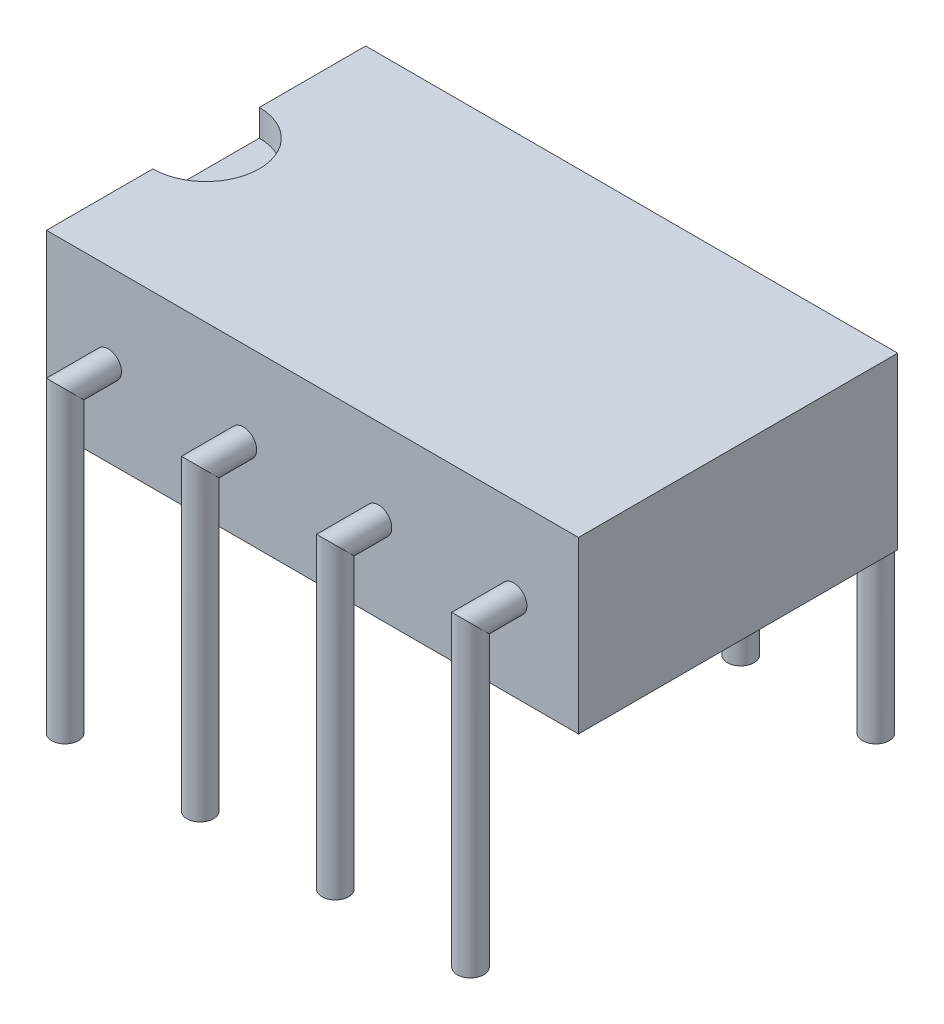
ISO-10303-21;
HEADER;
FILE_DESCRIPTION(('STEP AP214'),'2;1');
FILE_NAME('part.step','',(''),(''),'','','');
FILE_SCHEMA(('AUTOMOTIVE_DESIGN { 1 0 10303 214 1 1 1 1 }'));
ENDSEC;
DATA;
#1=APPLICATION_CONTEXT('core data for automotive mechanical design processes');
#2=APPLICATION_PROTOCOL_DEFINITION('international standard','automotive_design',2000,#1);
#3=PRODUCT_CONTEXT('',#1,'mechanical');
#4=PRODUCT('Part','Part','',(#3));
#5=PRODUCT_RELATED_PRODUCT_CATEGORY('part','',(#4));
#6=PRODUCT_DEFINITION_FORMATION('','',#4);
#7=PRODUCT_DEFINITION_CONTEXT('part definition',#1,'design');
#8=PRODUCT_DEFINITION('design','',#6,#7);
#9=PRODUCT_DEFINITION_SHAPE('','',#8);
#10=(LENGTH_UNIT() NAMED_UNIT(*) SI_UNIT(.MILLI.,.METRE.));
#11=(NAMED_UNIT(*) PLANE_ANGLE_UNIT() SI_UNIT($,.RADIAN.));
#12=(NAMED_UNIT(*) SI_UNIT($,.STERADIAN.) SOLID_ANGLE_UNIT());
#13=UNCERTAINTY_MEASURE_WITH_UNIT(LENGTH_MEASURE(1.E-05),#10,'distance_accuracy_value','');
#14=(GEOMETRIC_REPRESENTATION_CONTEXT(3) GLOBAL_UNCERTAINTY_ASSIGNED_CONTEXT((#13)) GLOBAL_UNIT_ASSIGNED_CONTEXT((#10,
#11,#12)) REPRESENTATION_CONTEXT('',''));
#15=CARTESIAN_POINT('',(0.,0.,0.));
#16=DIRECTION('',(0.,0.,1.));
#17=DIRECTION('',(1.,0.,0.));
#18=AXIS2_PLACEMENT_3D('',#15,#16,#17);
#19=CARTESIAN_POINT('',(10.,3.2,3.));
#20=DIRECTION('',(0.,0.,-1.));
#21=DIRECTION('',(-1.,0.,0.));
#22=AXIS2_PLACEMENT_3D('',#19,#20,#21);
#23=PLANE('',#22);
#24=CARTESIAN_POINT('',(6.24,1.6,3.));
#25=DIRECTION('',(0.,0.,-1.));
#26=DIRECTION('',(-1.,0.,0.));
#27=AXIS2_PLACEMENT_3D('',#24,#25,#26);
#28=CIRCLE('',#27,0.25);
#29=CARTESIAN_POINT('',(5.99,1.6,3.));
#30=VERTEX_POINT('',#29);
#31=EDGE_CURVE('E49',#30,#30,#28,.F.);
#32=ORIENTED_EDGE('',*,*,#31,.F.);
#33=EDGE_LOOP('',(#32));
#34=FACE_BOUND('',#33,.T.);
#35=CARTESIAN_POINT('',(1.16,1.6,3.));
#36=DIRECTION('',(0.,0.,-1.));
#37=DIRECTION('',(-1.,0.,0.));
#38=AXIS2_PLACEMENT_3D('',#35,#36,#37);
#39=CIRCLE('',#38,0.25);
#40=CARTESIAN_POINT('',(0.91,1.6,3.));
#41=VERTEX_POINT('',#40);
#42=EDGE_CURVE('E146',#41,#41,#39,.F.);
#43=ORIENTED_EDGE('',*,*,#42,.F.);
#44=EDGE_LOOP('',(#43));
#45=FACE_BOUND('',#44,.T.);
#46=DIRECTION('',(0.,-1.,0.));
#47=VECTOR('',#46,1.);
#48=CARTESIAN_POINT('',(0.,3.2,3.));
#49=LINE('',#48,#47);
#50=CARTESIAN_POINT('',(0.,3.2,3.));
#51=VERTEX_POINT('',#50);
#52=CARTESIAN_POINT('',(0.,0.,3.));
#53=VERTEX_POINT('',#52);
#54=EDGE_CURVE('E116',#51,#53,#49,.T.);
#55=ORIENTED_EDGE('',*,*,#54,.T.);
#56=DIRECTION('',(-1.,0.,0.));
#57=VECTOR('',#56,1.);
#58=CARTESIAN_POINT('',(10.,0.,3.));
#59=LINE('',#58,#57);
#60=CARTESIAN_POINT('',(10.,0.,3.));
#61=VERTEX_POINT('',#60);
#62=EDGE_CURVE('E144',#61,#53,#59,.T.);
#63=ORIENTED_EDGE('',*,*,#62,.F.);
#64=DIRECTION('',(0.,-1.,0.));
#65=VECTOR('',#64,1.);
#66=CARTESIAN_POINT('',(10.,3.2,3.));
#67=LINE('',#66,#65);
#68=CARTESIAN_POINT('',(10.,3.2,3.));
#69=VERTEX_POINT('',#68);
#70=EDGE_CURVE('E124',#69,#61,#67,.T.);
#71=ORIENTED_EDGE('',*,*,#70,.F.);
#72=DIRECTION('',(-1.,0.,0.));
#73=VECTOR('',#72,1.);
#74=CARTESIAN_POINT('',(10.,3.2,3.));
#75=LINE('',#74,#73);
#76=EDGE_CURVE('E130',#69,#51,#75,.T.);
#77=ORIENTED_EDGE('',*,*,#76,.T.);
#78=EDGE_LOOP('',(#55,#63,#71,#77));
#79=FACE_BOUND('',#78,.T.);
#80=CARTESIAN_POINT('',(3.7,1.6,3.));
#81=DIRECTION('',(0.,0.,-1.));
#82=DIRECTION('',(-1.,0.,0.));
#83=AXIS2_PLACEMENT_3D('',#80,#81,#82);
#84=CIRCLE('',#83,0.25);
#85=CARTESIAN_POINT('',(3.45,1.6,3.));
#86=VERTEX_POINT('',#85);
#87=EDGE_CURVE('E149',#86,#86,#84,.F.);
#88=ORIENTED_EDGE('',*,*,#87,.F.);
#89=EDGE_LOOP('',(#88));
#90=FACE_BOUND('',#89,.T.);
#91=CARTESIAN_POINT('',(8.78,1.6,3.));
#92=DIRECTION('',(0.,0.,-1.));
#93=DIRECTION('',(-1.,0.,0.));
#94=AXIS2_PLACEMENT_3D('',#91,#92,#93);
#95=CIRCLE('',#94,0.25);
#96=CARTESIAN_POINT('',(8.53,1.6,3.));
#97=VERTEX_POINT('',#96);
#98=EDGE_CURVE('E12',#97,#97,#95,.F.);
#99=ORIENTED_EDGE('',*,*,#98,.F.);
#100=EDGE_LOOP('',(#99));
#101=FACE_BOUND('',#100,.T.);
#102=ADVANCED_FACE('F42',(#34,#45,#79,#90,#101),#23,.F.);
#103=CARTESIAN_POINT('',(10.,0.,3.));
#104=DIRECTION('',(0.,1.,0.));
#105=DIRECTION('',(0.,0.,1.));
#106=AXIS2_PLACEMENT_3D('',#103,#104,#105);
#107=PLANE('',#106);
#108=DIRECTION('',(0.,0.,-1.));
#109=VECTOR('',#108,1.);
#110=CARTESIAN_POINT('',(0.,0.,3.));
#111=LINE('',#110,#109);
#112=CARTESIAN_POINT('',(0.,0.,-3.));
#113=VERTEX_POINT('',#112);
#114=EDGE_CURVE('E119',#53,#113,#111,.T.);
#115=ORIENTED_EDGE('',*,*,#114,.T.);
#116=DIRECTION('',(-1.,0.,0.));
#117=VECTOR('',#116,1.);
#118=CARTESIAN_POINT('',(10.,0.,-3.));
#119=LINE('',#118,#117);
#120=CARTESIAN_POINT('',(10.,0.,-3.));
#121=VERTEX_POINT('',#120);
#122=EDGE_CURVE('E141',#121,#113,#119,.T.);
#123=ORIENTED_EDGE('',*,*,#122,.F.);
#124=DIRECTION('',(0.,0.,-1.));
#125=VECTOR('',#124,1.);
#126=CARTESIAN_POINT('',(10.,0.,3.));
#127=LINE('',#126,#125);
#128=EDGE_CURVE('E93',#61,#121,#127,.T.);
#129=ORIENTED_EDGE('',*,*,#128,.F.);
#130=ORIENTED_EDGE('',*,*,#62,.T.);
#131=EDGE_LOOP('',(#115,#123,#129,#130));
#132=FACE_BOUND('',#131,.T.);
#133=ADVANCED_FACE('F159',(#132),#107,.F.);
#134=CARTESIAN_POINT('',(10.,3.2,-3.));
#135=DIRECTION('',(0.,0.,1.));
#136=DIRECTION('',(1.,0.,0.));
#137=AXIS2_PLACEMENT_3D('',#134,#135,#136);
#138=PLANE('',#137);
#139=CARTESIAN_POINT('',(8.78,1.6,-3.));
#140=DIRECTION('',(0.,0.,1.));
#141=DIRECTION('',(1.,0.,0.));
#142=AXIS2_PLACEMENT_3D('',#139,#140,#141);
#143=CIRCLE('',#142,0.25);
#144=CARTESIAN_POINT('',(9.03,1.6,-3.));
#145=VERTEX_POINT('',#144);
#146=EDGE_CURVE('E523',#145,#145,#143,.T.);
#147=ORIENTED_EDGE('',*,*,#146,.T.);
#148=EDGE_LOOP('',(#147));
#149=FACE_BOUND('',#148,.T.);
#150=CARTESIAN_POINT('',(6.24,1.6,-3.));
#151=DIRECTION('',(0.,0.,1.));
#152=DIRECTION('',(1.,0.,0.));
#153=AXIS2_PLACEMENT_3D('',#150,#151,#152);
#154=CIRCLE('',#153,0.25);
#155=CARTESIAN_POINT('',(6.49,1.6,-3.));
#156=VERTEX_POINT('',#155);
#157=EDGE_CURVE('E516',#156,#156,#154,.T.);
#158=ORIENTED_EDGE('',*,*,#157,.T.);
#159=EDGE_LOOP('',(#158));
#160=FACE_BOUND('',#159,.T.);
#161=CARTESIAN_POINT('',(3.7,1.6,-3.));
#162=DIRECTION('',(0.,0.,1.));
#163=DIRECTION('',(1.,0.,0.));
#164=AXIS2_PLACEMENT_3D('',#161,#162,#163);
#165=CIRCLE('',#164,0.25);
#166=CARTESIAN_POINT('',(3.95,1.6,-3.));
#167=VERTEX_POINT('',#166);
#168=EDGE_CURVE('E532',#167,#167,#165,.T.);
#169=ORIENTED_EDGE('',*,*,#168,.T.);
#170=EDGE_LOOP('',(#169));
#171=FACE_BOUND('',#170,.T.);
#172=CARTESIAN_POINT('',(1.16,1.6,-3.));
#173=DIRECTION('',(0.,0.,1.));
#174=DIRECTION('',(1.,0.,0.));
#175=AXIS2_PLACEMENT_3D('',#172,#173,#174);
#176=CIRCLE('',#175,0.25);
#177=CARTESIAN_POINT('',(1.41,1.6,-3.));
#178=VERTEX_POINT('',#177);
#179=EDGE_CURVE('E200',#178,#178,#176,.T.);
#180=ORIENTED_EDGE('',*,*,#179,.T.);
#181=EDGE_LOOP('',(#180));
#182=FACE_BOUND('',#181,.T.);
#183=DIRECTION('',(0.,1.,0.));
#184=VECTOR('',#183,1.);
#185=CARTESIAN_POINT('',(0.,3.2,-3.));
#186=LINE('',#185,#184);
#187=CARTESIAN_POINT('',(0.,3.2,-3.));
#188=VERTEX_POINT('',#187);
#189=EDGE_CURVE('E133',#113,#188,#186,.T.);
#190=ORIENTED_EDGE('',*,*,#189,.T.);
#191=DIRECTION('',(-1.,0.,0.));
#192=VECTOR('',#191,1.);
#193=CARTESIAN_POINT('',(10.,3.2,-3.));
#194=LINE('',#193,#192);
#195=CARTESIAN_POINT('',(10.,3.2,-3.));
#196=VERTEX_POINT('',#195);
#197=EDGE_CURVE('E138',#196,#188,#194,.T.);
#198=ORIENTED_EDGE('',*,*,#197,.F.);
#199=DIRECTION('',(0.,1.,0.));
#200=VECTOR('',#199,1.);
#201=CARTESIAN_POINT('',(10.,3.2,-3.));
#202=LINE('',#201,#200);
#203=EDGE_CURVE('E128',#121,#196,#202,.T.);
#204=ORIENTED_EDGE('',*,*,#203,.F.);
#205=ORIENTED_EDGE('',*,*,#122,.T.);
#206=EDGE_LOOP('',(#190,#198,#204,#205));
#207=FACE_BOUND('',#206,.T.);
#208=ADVANCED_FACE('F222',(#149,#160,#171,#182,#207),#138,.F.);
#209=CARTESIAN_POINT('',(10.,3.2,3.));
#210=DIRECTION('',(0.,-1.,0.));
#211=DIRECTION('',(0.,0.,-1.));
#212=AXIS2_PLACEMENT_3D('',#209,#210,#211);
#213=PLANE('',#212);
#214=DIRECTION('',(0.,0.,1.));
#215=VECTOR('',#214,1.);
#216=CARTESIAN_POINT('',(0.,3.2,3.));
#217=LINE('',#216,#215);
#218=CARTESIAN_POINT('',(0.,3.2,-1.));
#219=VERTEX_POINT('',#218);
#220=EDGE_CURVE('E126',#188,#219,#217,.T.);
#221=ORIENTED_EDGE('',*,*,#220,.T.);
#222=CARTESIAN_POINT('',(0.,3.2,0.));
#223=DIRECTION('',(0.,1.,0.));
#224=DIRECTION('',(0.,0.,1.));
#225=AXIS2_PLACEMENT_3D('',#222,#223,#224);
#226=CIRCLE('',#225,1.);
#227=CARTESIAN_POINT('',(0.,3.2,1.));
#228=VERTEX_POINT('',#227);
#229=EDGE_CURVE('E109',#228,#219,#226,.T.);
#230=ORIENTED_EDGE('',*,*,#229,.F.);
#231=EDGE_CURVE('E85',#228,#51,#217,.T.);
#232=ORIENTED_EDGE('',*,*,#231,.T.);
#233=ORIENTED_EDGE('',*,*,#76,.F.);
#234=DIRECTION('',(0.,0.,1.));
#235=VECTOR('',#234,1.);
#236=CARTESIAN_POINT('',(10.,3.2,3.));
#237=LINE('',#236,#235);
#238=EDGE_CURVE('E64',#196,#69,#237,.T.);
#239=ORIENTED_EDGE('',*,*,#238,.F.);
#240=ORIENTED_EDGE('',*,*,#197,.T.);
#241=EDGE_LOOP('',(#221,#230,#232,#233,#239,#240));
#242=FACE_BOUND('',#241,.T.);
#243=ADVANCED_FACE('F218',(#242),#213,.F.);
#244=CARTESIAN_POINT('',(10.,0.,3.));
#245=DIRECTION('',(1.,0.,0.));
#246=DIRECTION('',(0.,0.,-1.));
#247=AXIS2_PLACEMENT_3D('',#244,#245,#246);
#248=PLANE('',#247);
#249=ORIENTED_EDGE('',*,*,#70,.T.);
#250=ORIENTED_EDGE('',*,*,#128,.T.);
#251=ORIENTED_EDGE('',*,*,#203,.T.);
#252=ORIENTED_EDGE('',*,*,#238,.T.);
#253=EDGE_LOOP('',(#249,#250,#251,#252));
#254=FACE_BOUND('',#253,.T.);
#255=ADVANCED_FACE('F224',(#254),#248,.T.);
#256=CARTESIAN_POINT('',(0.,0.,3.));
#257=DIRECTION('',(1.,0.,0.));
#258=DIRECTION('',(0.,0.,-1.));
#259=AXIS2_PLACEMENT_3D('',#256,#257,#258);
#260=PLANE('',#259);
#261=DIRECTION('',(0.,0.,1.));
#262=VECTOR('',#261,1.);
#263=CARTESIAN_POINT('',(0.,2.7,-1.));
#264=LINE('',#263,#262);
#265=CARTESIAN_POINT('',(0.,2.7,-1.));
#266=VERTEX_POINT('',#265);
#267=CARTESIAN_POINT('',(0.,2.7,1.));
#268=VERTEX_POINT('',#267);
#269=EDGE_CURVE('E108',#266,#268,#264,.T.);
#270=ORIENTED_EDGE('',*,*,#269,.F.);
#271=DIRECTION('',(0.,1.,0.));
#272=VECTOR('',#271,1.);
#273=CARTESIAN_POINT('',(0.,2.7,-1.));
#274=LINE('',#273,#272);
#275=EDGE_CURVE('E106',#266,#219,#274,.T.);
#276=ORIENTED_EDGE('',*,*,#275,.T.);
#277=ORIENTED_EDGE('',*,*,#220,.F.);
#278=ORIENTED_EDGE('',*,*,#189,.F.);
#279=ORIENTED_EDGE('',*,*,#114,.F.);
#280=ORIENTED_EDGE('',*,*,#54,.F.);
#281=ORIENTED_EDGE('',*,*,#231,.F.);
#282=DIRECTION('',(0.,1.,0.));
#283=VECTOR('',#282,1.);
#284=CARTESIAN_POINT('',(0.,2.7,1.));
#285=LINE('',#284,#283);
#286=EDGE_CURVE('E104',#268,#228,#285,.T.);
#287=ORIENTED_EDGE('',*,*,#286,.F.);
#288=EDGE_LOOP('',(#270,#276,#277,#278,#279,#280,#281,#287));
#289=FACE_BOUND('',#288,.T.);
#290=ADVANCED_FACE('F114',(#289),#260,.F.);
#291=CARTESIAN_POINT('',(0.,2.7,0.));
#292=DIRECTION('',(0.,1.,0.));
#293=DIRECTION('',(0.,0.,1.));
#294=AXIS2_PLACEMENT_3D('',#291,#292,#293);
#295=CYLINDRICAL_SURFACE('',#294,1.);
#296=ORIENTED_EDGE('',*,*,#229,.T.);
#297=ORIENTED_EDGE('',*,*,#275,.F.);
#298=CARTESIAN_POINT('',(0.,2.7,0.));
#299=DIRECTION('',(0.,1.,0.));
#300=DIRECTION('',(0.,0.,1.));
#301=AXIS2_PLACEMENT_3D('',#298,#299,#300);
#302=CIRCLE('',#301,1.);
#303=EDGE_CURVE('E55',#268,#266,#302,.T.);
#304=ORIENTED_EDGE('',*,*,#303,.F.);
#305=ORIENTED_EDGE('',*,*,#286,.T.);
#306=EDGE_LOOP('',(#296,#297,#304,#305));
#307=FACE_BOUND('',#306,.T.);
#308=ADVANCED_FACE('F102',(#307),#295,.F.);
#309=CARTESIAN_POINT('',(0.,2.7,0.));
#310=DIRECTION('',(0.,1.,0.));
#311=DIRECTION('',(0.,0.,1.));
#312=AXIS2_PLACEMENT_3D('',#309,#310,#311);
#313=PLANE('',#312);
#314=ORIENTED_EDGE('',*,*,#303,.T.);
#315=ORIENTED_EDGE('',*,*,#269,.T.);
#316=EDGE_LOOP('',(#314,#315));
#317=FACE_BOUND('',#316,.T.);
#318=ADVANCED_FACE('F111',(#317),#313,.T.);
#319=CARTESIAN_POINT('',(1.16,1.6,3.81));
#320=DIRECTION('',(0.,-1.,0.));
#321=DIRECTION('',(0.,0.,-1.));
#322=AXIS2_PLACEMENT_3D('',#319,#320,#321);
#323=CYLINDRICAL_SURFACE('',#322,0.25);
#324=CARTESIAN_POINT('',(1.16,1.6,3.81));
#325=DIRECTION('',(0.,-0.707106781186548,0.707106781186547));
#326=DIRECTION('',(0.,-0.707106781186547,-0.707106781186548));
#327=AXIS2_PLACEMENT_3D('',#324,#325,#326);
#328=ELLIPSE('',#327,0.353553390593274,0.25);
#329=CARTESIAN_POINT('',(1.16,1.35,3.56));
#330=VERTEX_POINT('',#329);
#331=EDGE_CURVE('E209',#330,#330,#328,.T.);
#332=ORIENTED_EDGE('',*,*,#331,.T.);
#333=EDGE_LOOP('',(#332));
#334=FACE_BOUND('',#333,.T.);
#335=CARTESIAN_POINT('',(1.16,-4.,3.81));
#336=DIRECTION('',(0.,-1.,0.));
#337=DIRECTION('',(0.,0.,-1.));
#338=AXIS2_PLACEMENT_3D('',#335,#336,#337);
#339=CIRCLE('',#338,0.25);
#340=CARTESIAN_POINT('',(1.16,-4.,3.56));
#341=VERTEX_POINT('',#340);
#342=EDGE_CURVE('E212',#341,#341,#339,.F.);
#343=ORIENTED_EDGE('',*,*,#342,.T.);
#344=EDGE_LOOP('',(#343));
#345=FACE_BOUND('',#344,.T.);
#346=ADVANCED_FACE('F276',(#334,#345),#323,.T.);
#347=CARTESIAN_POINT('',(1.16,1.6,4.51710678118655));
#348=DIRECTION('',(0.,0.,-1.));
#349=DIRECTION('',(-1.,0.,0.));
#350=AXIS2_PLACEMENT_3D('',#347,#348,#349);
#351=CYLINDRICAL_SURFACE('',#350,0.25);
#352=ORIENTED_EDGE('',*,*,#42,.T.);
#353=EDGE_LOOP('',(#352));
#354=FACE_BOUND('',#353,.T.);
#355=ORIENTED_EDGE('',*,*,#331,.F.);
#356=EDGE_LOOP('',(#355));
#357=FACE_BOUND('',#356,.T.);
#358=ADVANCED_FACE('F284',(#354,#357),#351,.T.);
#359=CARTESIAN_POINT('',(1.16,-4.,3.81));
#360=DIRECTION('',(0.,-1.,0.));
#361=DIRECTION('',(0.,0.,-1.));
#362=AXIS2_PLACEMENT_3D('',#359,#360,#361);
#363=PLANE('',#362);
#364=ORIENTED_EDGE('',*,*,#342,.F.);
#365=EDGE_LOOP('',(#364));
#366=FACE_BOUND('',#365,.T.);
#367=ADVANCED_FACE('F294',(#366),#363,.T.);
#368=CARTESIAN_POINT('',(1.16,1.6,-3.81));
#369=DIRECTION('',(0.,-1.,0.));
#370=DIRECTION('',(0.,0.,-1.));
#371=AXIS2_PLACEMENT_3D('',#368,#369,#370);
#372=CYLINDRICAL_SURFACE('',#371,0.25);
#373=CARTESIAN_POINT('',(1.16,1.6,-3.81));
#374=DIRECTION('',(0.,-0.707106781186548,-0.707106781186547));
#375=DIRECTION('',(0.,-0.707106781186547,0.707106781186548));
#376=AXIS2_PLACEMENT_3D('',#373,#374,#375);
#377=ELLIPSE('',#376,0.353553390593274,0.25);
#378=CARTESIAN_POINT('',(1.16,1.35,-3.56));
#379=VERTEX_POINT('',#378);
#380=EDGE_CURVE('E203',#379,#379,#377,.F.);
#381=ORIENTED_EDGE('',*,*,#380,.F.);
#382=EDGE_LOOP('',(#381));
#383=FACE_BOUND('',#382,.T.);
#384=CARTESIAN_POINT('',(1.16,-4.,-3.81));
#385=DIRECTION('',(0.,-1.,0.));
#386=DIRECTION('',(0.,0.,-1.));
#387=AXIS2_PLACEMENT_3D('',#384,#385,#386);
#388=CIRCLE('',#387,0.25);
#389=CARTESIAN_POINT('',(1.16,-4.,-4.06));
#390=VERTEX_POINT('',#389);
#391=EDGE_CURVE('E206',#390,#390,#388,.T.);
#392=ORIENTED_EDGE('',*,*,#391,.F.);
#393=EDGE_LOOP('',(#392));
#394=FACE_BOUND('',#393,.T.);
#395=ADVANCED_FACE('F304',(#383,#394),#372,.T.);
#396=CARTESIAN_POINT('',(1.16,1.6,-4.51710678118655));
#397=DIRECTION('',(0.,0.,1.));
#398=DIRECTION('',(1.,0.,0.));
#399=AXIS2_PLACEMENT_3D('',#396,#397,#398);
#400=CYLINDRICAL_SURFACE('',#399,0.25);
#401=ORIENTED_EDGE('',*,*,#179,.F.);
#402=EDGE_LOOP('',(#401));
#403=FACE_BOUND('',#402,.T.);
#404=ORIENTED_EDGE('',*,*,#380,.T.);
#405=EDGE_LOOP('',(#404));
#406=FACE_BOUND('',#405,.T.);
#407=ADVANCED_FACE('F314',(#403,#406),#400,.T.);
#408=CARTESIAN_POINT('',(1.16,-4.,-3.81));
#409=DIRECTION('',(0.,-1.,0.));
#410=DIRECTION('',(0.,0.,-1.));
#411=AXIS2_PLACEMENT_3D('',#408,#409,#410);
#412=PLANE('',#411);
#413=ORIENTED_EDGE('',*,*,#391,.T.);
#414=EDGE_LOOP('',(#413));
#415=FACE_BOUND('',#414,.T.);
#416=ADVANCED_FACE('F324',(#415),#412,.T.);
#417=CARTESIAN_POINT('',(3.7,1.6,3.81));
#418=DIRECTION('',(0.,-1.,0.));
#419=DIRECTION('',(0.,0.,-1.));
#420=AXIS2_PLACEMENT_3D('',#417,#418,#419);
#421=CYLINDRICAL_SURFACE('',#420,0.25);
#422=CARTESIAN_POINT('',(3.7,1.6,3.81));
#423=DIRECTION('',(0.,-0.707106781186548,0.707106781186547));
#424=DIRECTION('',(0.,-0.707106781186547,-0.707106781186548));
#425=AXIS2_PLACEMENT_3D('',#422,#423,#424);
#426=ELLIPSE('',#425,0.353553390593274,0.25);
#427=CARTESIAN_POINT('',(3.7,1.35,3.56));
#428=VERTEX_POINT('',#427);
#429=EDGE_CURVE('E194',#428,#428,#426,.T.);
#430=ORIENTED_EDGE('',*,*,#429,.T.);
#431=EDGE_LOOP('',(#430));
#432=FACE_BOUND('',#431,.T.);
#433=CARTESIAN_POINT('',(3.7,-4.,3.81));
#434=DIRECTION('',(0.,-1.,0.));
#435=DIRECTION('',(0.,0.,-1.));
#436=AXIS2_PLACEMENT_3D('',#433,#434,#435);
#437=CIRCLE('',#436,0.25);
#438=CARTESIAN_POINT('',(3.7,-4.,3.56));
#439=VERTEX_POINT('',#438);
#440=EDGE_CURVE('E197',#439,#439,#437,.F.);
#441=ORIENTED_EDGE('',*,*,#440,.T.);
#442=EDGE_LOOP('',(#441));
#443=FACE_BOUND('',#442,.T.);
#444=ADVANCED_FACE('F333',(#432,#443),#421,.T.);
#445=CARTESIAN_POINT('',(3.7,1.6,4.51710678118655));
#446=DIRECTION('',(0.,0.,-1.));
#447=DIRECTION('',(-1.,0.,0.));
#448=AXIS2_PLACEMENT_3D('',#445,#446,#447);
#449=CYLINDRICAL_SURFACE('',#448,0.25);
#450=ORIENTED_EDGE('',*,*,#87,.T.);
#451=EDGE_LOOP('',(#450));
#452=FACE_BOUND('',#451,.T.);
#453=ORIENTED_EDGE('',*,*,#429,.F.);
#454=EDGE_LOOP('',(#453));
#455=FACE_BOUND('',#454,.T.);
#456=ADVANCED_FACE('F348',(#452,#455),#449,.T.);
#457=CARTESIAN_POINT('',(3.7,-4.,3.81));
#458=DIRECTION('',(0.,-1.,0.));
#459=DIRECTION('',(0.,0.,-1.));
#460=AXIS2_PLACEMENT_3D('',#457,#458,#459);
#461=PLANE('',#460);
#462=ORIENTED_EDGE('',*,*,#440,.F.);
#463=EDGE_LOOP('',(#462));
#464=FACE_BOUND('',#463,.T.);
#465=ADVANCED_FACE('F357',(#464),#461,.T.);
#466=CARTESIAN_POINT('',(6.24,1.6,3.81));
#467=DIRECTION('',(0.,-1.,0.));
#468=DIRECTION('',(0.,0.,-1.));
#469=AXIS2_PLACEMENT_3D('',#466,#467,#468);
#470=CYLINDRICAL_SURFACE('',#469,0.25);
#471=CARTESIAN_POINT('',(6.24,1.6,3.81));
#472=DIRECTION('',(0.,-0.707106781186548,0.707106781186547));
#473=DIRECTION('',(0.,-0.707106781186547,-0.707106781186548));
#474=AXIS2_PLACEMENT_3D('',#471,#472,#473);
#475=ELLIPSE('',#474,0.353553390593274,0.25);
#476=CARTESIAN_POINT('',(6.24,1.35,3.56));
#477=VERTEX_POINT('',#476);
#478=EDGE_CURVE('E182',#477,#477,#475,.T.);
#479=ORIENTED_EDGE('',*,*,#478,.T.);
#480=EDGE_LOOP('',(#479));
#481=FACE_BOUND('',#480,.T.);
#482=CARTESIAN_POINT('',(6.24,-4.,3.81));
#483=DIRECTION('',(0.,-1.,0.));
#484=DIRECTION('',(0.,0.,-1.));
#485=AXIS2_PLACEMENT_3D('',#482,#483,#484);
#486=CIRCLE('',#485,0.25);
#487=CARTESIAN_POINT('',(6.24,-4.,3.56));
#488=VERTEX_POINT('',#487);
#489=EDGE_CURVE('E191',#488,#488,#486,.F.);
#490=ORIENTED_EDGE('',*,*,#489,.T.);
#491=EDGE_LOOP('',(#490));
#492=FACE_BOUND('',#491,.T.);
#493=ADVANCED_FACE('F366',(#481,#492),#470,.T.);
#494=CARTESIAN_POINT('',(6.24,1.6,4.51710678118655));
#495=DIRECTION('',(0.,0.,-1.));
#496=DIRECTION('',(-1.,0.,0.));
#497=AXIS2_PLACEMENT_3D('',#494,#495,#496);
#498=CYLINDRICAL_SURFACE('',#497,0.25);
#499=ORIENTED_EDGE('',*,*,#31,.T.);
#500=EDGE_LOOP('',(#499));
#501=FACE_BOUND('',#500,.T.);
#502=ORIENTED_EDGE('',*,*,#478,.F.);
#503=EDGE_LOOP('',(#502));
#504=FACE_BOUND('',#503,.T.);
#505=ADVANCED_FACE('F154',(#501,#504),#498,.T.);
#506=CARTESIAN_POINT('',(6.24,-4.,3.81));
#507=DIRECTION('',(0.,-1.,0.));
#508=DIRECTION('',(0.,0.,-1.));
#509=AXIS2_PLACEMENT_3D('',#506,#507,#508);
#510=PLANE('',#509);
#511=ORIENTED_EDGE('',*,*,#489,.F.);
#512=EDGE_LOOP('',(#511));
#513=FACE_BOUND('',#512,.T.);
#514=ADVANCED_FACE('F383',(#513),#510,.T.);
#515=CARTESIAN_POINT('',(8.78,1.6,3.81));
#516=DIRECTION('',(0.,-1.,0.));
#517=DIRECTION('',(0.,0.,-1.));
#518=AXIS2_PLACEMENT_3D('',#515,#516,#517);
#519=CYLINDRICAL_SURFACE('',#518,0.25);
#520=CARTESIAN_POINT('',(8.78,1.6,3.81));
#521=DIRECTION('',(0.,-0.707106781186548,0.707106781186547));
#522=DIRECTION('',(0.,-0.707106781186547,-0.707106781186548));
#523=AXIS2_PLACEMENT_3D('',#520,#521,#522);
#524=ELLIPSE('',#523,0.353553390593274,0.25);
#525=CARTESIAN_POINT('',(8.78,1.35,3.56));
#526=VERTEX_POINT('',#525);
#527=EDGE_CURVE('E176',#526,#526,#524,.T.);
#528=ORIENTED_EDGE('',*,*,#527,.T.);
#529=EDGE_LOOP('',(#528));
#530=FACE_BOUND('',#529,.T.);
#531=CARTESIAN_POINT('',(8.78,-4.,3.81));
#532=DIRECTION('',(0.,-1.,0.));
#533=DIRECTION('',(0.,0.,-1.));
#534=AXIS2_PLACEMENT_3D('',#531,#532,#533);
#535=CIRCLE('',#534,0.25);
#536=CARTESIAN_POINT('',(8.78,-4.,3.56));
#537=VERTEX_POINT('',#536);
#538=EDGE_CURVE('E178',#537,#537,#535,.F.);
#539=ORIENTED_EDGE('',*,*,#538,.T.);
#540=EDGE_LOOP('',(#539));
#541=FACE_BOUND('',#540,.T.);
#542=ADVANCED_FACE('F172',(#530,#541),#519,.T.);
#543=CARTESIAN_POINT('',(8.78,1.6,4.51710678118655));
#544=DIRECTION('',(0.,0.,-1.));
#545=DIRECTION('',(-1.,0.,0.));
#546=AXIS2_PLACEMENT_3D('',#543,#544,#545);
#547=CYLINDRICAL_SURFACE('',#546,0.25);
#548=ORIENTED_EDGE('',*,*,#98,.T.);
#549=EDGE_LOOP('',(#548));
#550=FACE_BOUND('',#549,.T.);
#551=ORIENTED_EDGE('',*,*,#527,.F.);
#552=EDGE_LOOP('',(#551));
#553=FACE_BOUND('',#552,.T.);
#554=ADVANCED_FACE('F168',(#550,#553),#547,.T.);
#555=CARTESIAN_POINT('',(8.78,-4.,3.81));
#556=DIRECTION('',(0.,-1.,0.));
#557=DIRECTION('',(0.,0.,-1.));
#558=AXIS2_PLACEMENT_3D('',#555,#556,#557);
#559=PLANE('',#558);
#560=ORIENTED_EDGE('',*,*,#538,.F.);
#561=EDGE_LOOP('',(#560));
#562=FACE_BOUND('',#561,.T.);
#563=ADVANCED_FACE('F171',(#562),#559,.T.);
#564=CARTESIAN_POINT('',(3.7,1.6,-3.81));
#565=DIRECTION('',(0.,-1.,0.));
#566=DIRECTION('',(0.,0.,-1.));
#567=AXIS2_PLACEMENT_3D('',#564,#565,#566);
#568=CYLINDRICAL_SURFACE('',#567,0.25);
#569=CARTESIAN_POINT('',(3.7,1.6,-3.81));
#570=DIRECTION('',(0.,-0.707106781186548,-0.707106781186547));
#571=DIRECTION('',(0.,-0.707106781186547,0.707106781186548));
#572=AXIS2_PLACEMENT_3D('',#569,#570,#571);
#573=ELLIPSE('',#572,0.353553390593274,0.25);
#574=CARTESIAN_POINT('',(3.7,1.35,-3.56));
#575=VERTEX_POINT('',#574);
#576=EDGE_CURVE('E185',#575,#575,#573,.F.);
#577=ORIENTED_EDGE('',*,*,#576,.F.);
#578=EDGE_LOOP('',(#577));
#579=FACE_BOUND('',#578,.T.);
#580=CARTESIAN_POINT('',(3.7,-4.,-3.81));
#581=DIRECTION('',(0.,-1.,0.));
#582=DIRECTION('',(0.,0.,-1.));
#583=AXIS2_PLACEMENT_3D('',#580,#581,#582);
#584=CIRCLE('',#583,0.25);
#585=CARTESIAN_POINT('',(3.7,-4.,-4.06));
#586=VERTEX_POINT('',#585);
#587=EDGE_CURVE('E179',#586,#586,#584,.T.);
#588=ORIENTED_EDGE('',*,*,#587,.F.);
#589=EDGE_LOOP('',(#588));
#590=FACE_BOUND('',#589,.T.);
#591=ADVANCED_FACE('F411',(#579,#590),#568,.T.);
#592=CARTESIAN_POINT('',(3.7,1.6,-4.51710678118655));
#593=DIRECTION('',(0.,0.,1.));
#594=DIRECTION('',(1.,0.,0.));
#595=AXIS2_PLACEMENT_3D('',#592,#593,#594);
#596=CYLINDRICAL_SURFACE('',#595,0.25);
#597=ORIENTED_EDGE('',*,*,#168,.F.);
#598=EDGE_LOOP('',(#597));
#599=FACE_BOUND('',#598,.T.);
#600=ORIENTED_EDGE('',*,*,#576,.T.);
#601=EDGE_LOOP('',(#600));
#602=FACE_BOUND('',#601,.T.);
#603=ADVANCED_FACE('F420',(#599,#602),#596,.T.);
#604=CARTESIAN_POINT('',(3.7,-4.,-3.81));
#605=DIRECTION('',(0.,-1.,0.));
#606=DIRECTION('',(0.,0.,-1.));
#607=AXIS2_PLACEMENT_3D('',#604,#605,#606);
#608=PLANE('',#607);
#609=ORIENTED_EDGE('',*,*,#587,.T.);
#610=EDGE_LOOP('',(#609));
#611=FACE_BOUND('',#610,.T.);
#612=ADVANCED_FACE('F429',(#611),#608,.T.);
#613=CARTESIAN_POINT('',(6.24,1.6,-3.81));
#614=DIRECTION('',(0.,-1.,0.));
#615=DIRECTION('',(0.,0.,-1.));
#616=AXIS2_PLACEMENT_3D('',#613,#614,#615);
#617=CYLINDRICAL_SURFACE('',#616,0.25);
#618=CARTESIAN_POINT('',(6.24,1.6,-3.81));
#619=DIRECTION('',(0.,-0.707106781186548,-0.707106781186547));
#620=DIRECTION('',(0.,-0.707106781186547,0.707106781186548));
#621=AXIS2_PLACEMENT_3D('',#618,#619,#620);
#622=ELLIPSE('',#621,0.353553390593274,0.25);
#623=CARTESIAN_POINT('',(6.24,1.35,-3.56));
#624=VERTEX_POINT('',#623);
#625=EDGE_CURVE('E520',#624,#624,#622,.F.);
#626=ORIENTED_EDGE('',*,*,#625,.F.);
#627=EDGE_LOOP('',(#626));
#628=FACE_BOUND('',#627,.T.);
#629=CARTESIAN_POINT('',(6.24,-4.,-3.81));
#630=DIRECTION('',(0.,-1.,0.));
#631=DIRECTION('',(0.,0.,-1.));
#632=AXIS2_PLACEMENT_3D('',#629,#630,#631);
#633=CIRCLE('',#632,0.25);
#634=CARTESIAN_POINT('',(6.24,-4.,-4.06));
#635=VERTEX_POINT('',#634);
#636=EDGE_CURVE('E529',#635,#635,#633,.T.);
#637=ORIENTED_EDGE('',*,*,#636,.F.);
#638=EDGE_LOOP('',(#637));
#639=FACE_BOUND('',#638,.T.);
#640=ADVANCED_FACE('F438',(#628,#639),#617,.T.);
#641=CARTESIAN_POINT('',(6.24,1.6,-4.51710678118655));
#642=DIRECTION('',(0.,0.,1.));
#643=DIRECTION('',(1.,0.,0.));
#644=AXIS2_PLACEMENT_3D('',#641,#642,#643);
#645=CYLINDRICAL_SURFACE('',#644,0.25);
#646=ORIENTED_EDGE('',*,*,#157,.F.);
#647=EDGE_LOOP('',(#646));
#648=FACE_BOUND('',#647,.T.);
#649=ORIENTED_EDGE('',*,*,#625,.T.);
#650=EDGE_LOOP('',(#649));
#651=FACE_BOUND('',#650,.T.);
#652=ADVANCED_FACE('F447',(#648,#651),#645,.T.);
#653=CARTESIAN_POINT('',(6.24,-4.,-3.81));
#654=DIRECTION('',(0.,-1.,0.));
#655=DIRECTION('',(0.,0.,-1.));
#656=AXIS2_PLACEMENT_3D('',#653,#654,#655);
#657=PLANE('',#656);
#658=ORIENTED_EDGE('',*,*,#636,.T.);
#659=EDGE_LOOP('',(#658));
#660=FACE_BOUND('',#659,.T.);
#661=ADVANCED_FACE('F456',(#660),#657,.T.);
#662=CARTESIAN_POINT('',(8.78,1.6,-3.81));
#663=DIRECTION('',(0.,-1.,0.));
#664=DIRECTION('',(0.,0.,-1.));
#665=AXIS2_PLACEMENT_3D('',#662,#663,#664);
#666=CYLINDRICAL_SURFACE('',#665,0.25);
#667=CARTESIAN_POINT('',(8.78,1.6,-3.81));
#668=DIRECTION('',(0.,-0.707106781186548,-0.707106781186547));
#669=DIRECTION('',(0.,-0.707106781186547,0.707106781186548));
#670=AXIS2_PLACEMENT_3D('',#667,#668,#669);
#671=ELLIPSE('',#670,0.353553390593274,0.25);
#672=CARTESIAN_POINT('',(8.78,1.35,-3.56));
#673=VERTEX_POINT('',#672);
#674=EDGE_CURVE('E517',#673,#673,#671,.F.);
#675=ORIENTED_EDGE('',*,*,#674,.F.);
#676=EDGE_LOOP('',(#675));
#677=FACE_BOUND('',#676,.T.);
#678=CARTESIAN_POINT('',(8.78,-4.,-3.81));
#679=DIRECTION('',(0.,-1.,0.));
#680=DIRECTION('',(0.,0.,-1.));
#681=AXIS2_PLACEMENT_3D('',#678,#679,#680);
#682=CIRCLE('',#681,0.25);
#683=CARTESIAN_POINT('',(8.78,-4.,-4.06));
#684=VERTEX_POINT('',#683);
#685=EDGE_CURVE('E514',#684,#684,#682,.T.);
#686=ORIENTED_EDGE('',*,*,#685,.F.);
#687=EDGE_LOOP('',(#686));
#688=FACE_BOUND('',#687,.T.);
#689=ADVANCED_FACE('F465',(#677,#688),#666,.T.);
#690=CARTESIAN_POINT('',(8.78,1.6,-4.51710678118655));
#691=DIRECTION('',(0.,0.,1.));
#692=DIRECTION('',(1.,0.,0.));
#693=AXIS2_PLACEMENT_3D('',#690,#691,#692);
#694=CYLINDRICAL_SURFACE('',#693,0.25);
#695=ORIENTED_EDGE('',*,*,#146,.F.);
#696=EDGE_LOOP('',(#695));
#697=FACE_BOUND('',#696,.T.);
#698=ORIENTED_EDGE('',*,*,#674,.T.);
#699=EDGE_LOOP('',(#698));
#700=FACE_BOUND('',#699,.T.);
#701=ADVANCED_FACE('F474',(#697,#700),#694,.T.);
#702=CARTESIAN_POINT('',(8.78,-4.,-3.81));
#703=DIRECTION('',(0.,-1.,0.));
#704=DIRECTION('',(0.,0.,-1.));
#705=AXIS2_PLACEMENT_3D('',#702,#703,#704);
#706=PLANE('',#705);
#707=ORIENTED_EDGE('',*,*,#685,.T.);
#708=EDGE_LOOP('',(#707));
#709=FACE_BOUND('',#708,.T.);
#710=ADVANCED_FACE('F483',(#709),#706,.T.);
#711=CLOSED_SHELL('',(#102,#133,#208,#243,#255,#290,#308,#318,#346,#358,#367,#395,#407,#416,
#444,#456,#465,#493,#505,#514,#542,#554,#563,#591,#603,#612,#640,#652,#661,#689,#701,#710));
#712=MANIFOLD_SOLID_BREP('B2',#711);
#713=ADVANCED_BREP_SHAPE_REPRESENTATION('',(#18,#712),#14);
#714=SHAPE_DEFINITION_REPRESENTATION(#9,#713);
ENDSEC;
END-ISO-10303-21;
